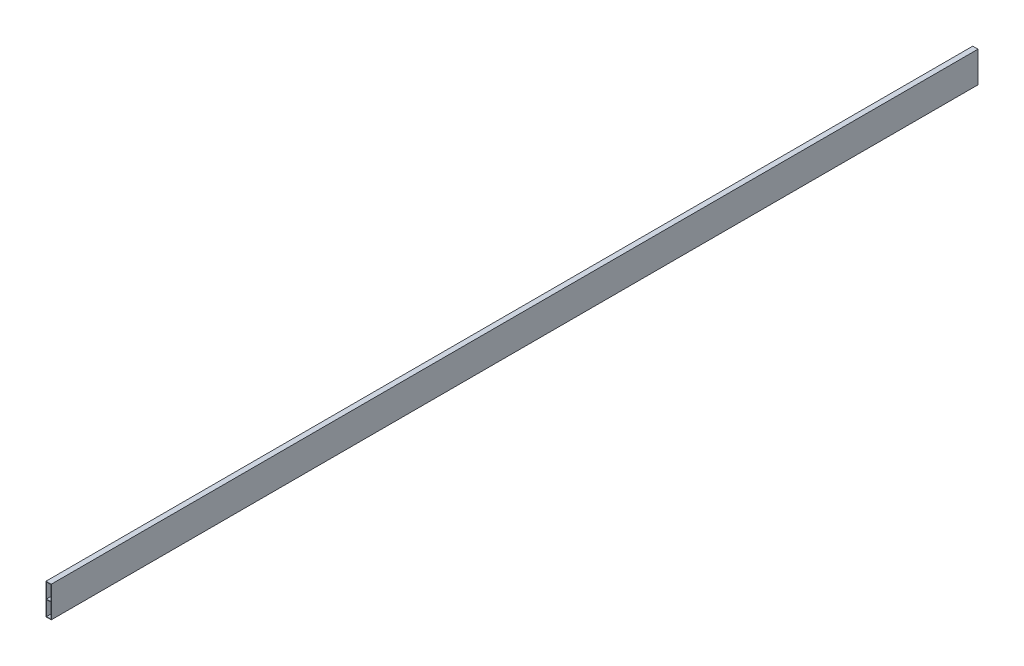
from build123d import *

# Parameters (mm, degrees)
ESQUISSE1_W          = 17
ESQUISSE1_H          = 100
ESQUISSE1_W_2        = 14
ESQUISSE1_H_2        = 97
PROFIL_DE_BASE_DEPTH = 3000
ESQUISSE2_W          = 14
ESQUISSE2_H          = 1.5
NERVURE_DEPTH        = 3000


with BuildPart() as part:
    # Esquisse1 → Profil de base (new body)
    with BuildSketch(Plane.XY):
        Rectangle(ESQUISSE1_W, ESQUISSE1_H)
        Rectangle(ESQUISSE1_W_2, ESQUISSE1_H_2, mode=Mode.SUBTRACT)
    extrude(amount=PROFIL_DE_BASE_DEPTH)

    # Esquisse2 → Nervure (add)
    with BuildSketch(Plane.XY):
        Rectangle(ESQUISSE2_W, ESQUISSE2_H)
    extrude(amount=NERVURE_DEPTH)


solid = part.part
